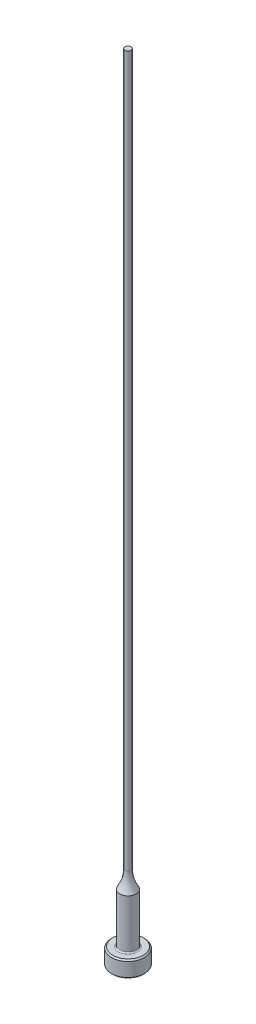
ISO-10303-21;
HEADER;
FILE_DESCRIPTION(('STEP AP214'),'2;1');
FILE_NAME('part.step','',(''),(''),'','','');
FILE_SCHEMA(('AUTOMOTIVE_DESIGN { 1 0 10303 214 1 1 1 1 }'));
ENDSEC;
DATA;
#1=APPLICATION_CONTEXT('core data for automotive mechanical design processes');
#2=APPLICATION_PROTOCOL_DEFINITION('international standard','automotive_design',2000,#1);
#3=PRODUCT_CONTEXT('',#1,'mechanical');
#4=PRODUCT('Part','Part','',(#3));
#5=PRODUCT_RELATED_PRODUCT_CATEGORY('part','',(#4));
#6=PRODUCT_DEFINITION_FORMATION('','',#4);
#7=PRODUCT_DEFINITION_CONTEXT('part definition',#1,'design');
#8=PRODUCT_DEFINITION('design','',#6,#7);
#9=PRODUCT_DEFINITION_SHAPE('','',#8);
#10=(LENGTH_UNIT() NAMED_UNIT(*) SI_UNIT(.MILLI.,.METRE.));
#11=(NAMED_UNIT(*) PLANE_ANGLE_UNIT() SI_UNIT($,.RADIAN.));
#12=(NAMED_UNIT(*) SI_UNIT($,.STERADIAN.) SOLID_ANGLE_UNIT());
#13=UNCERTAINTY_MEASURE_WITH_UNIT(LENGTH_MEASURE(1.E-05),#10,'distance_accuracy_value','');
#14=(GEOMETRIC_REPRESENTATION_CONTEXT(3) GLOBAL_UNCERTAINTY_ASSIGNED_CONTEXT((#13)) GLOBAL_UNIT_ASSIGNED_CONTEXT((#10,
#11,#12)) REPRESENTATION_CONTEXT('',''));
#15=CARTESIAN_POINT('',(0.,0.,0.));
#16=DIRECTION('',(0.,0.,1.));
#17=DIRECTION('',(1.,0.,0.));
#18=AXIS2_PLACEMENT_3D('',#15,#16,#17);
#19=CARTESIAN_POINT('',(-0.594359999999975,152.4,0.));
#20=DIRECTION('',(0.,1.,0.));
#21=DIRECTION('',(0.,0.,1.));
#22=AXIS2_PLACEMENT_3D('',#19,#20,#21);
#23=PLANE('',#22);
#24=CARTESIAN_POINT('',(0.,152.4,0.));
#25=DIRECTION('',(0.,1.,0.));
#26=DIRECTION('',(0.,0.,1.));
#27=AXIS2_PLACEMENT_3D('',#24,#25,#26);
#28=CIRCLE('',#27,0.594359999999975);
#29=CARTESIAN_POINT('',(0.,152.4,0.594359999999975));
#30=VERTEX_POINT('',#29);
#31=EDGE_CURVE('E61',#30,#30,#28,.T.);
#32=ORIENTED_EDGE('',*,*,#31,.T.);
#33=EDGE_LOOP('',(#32));
#34=FACE_BOUND('',#33,.T.);
#35=ADVANCED_FACE('F35',(#34),#23,.T.);
#36=CARTESIAN_POINT('',(0.,259.958771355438,0.));
#37=DIRECTION('',(0.,1.,0.));
#38=DIRECTION('',(0.,0.,1.));
#39=AXIS2_PLACEMENT_3D('',#36,#37,#38);
#40=CYLINDRICAL_SURFACE('',#39,0.594359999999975);
#41=CARTESIAN_POINT('',(0.,16.1097728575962,0.));
#42=DIRECTION('',(0.,1.,0.));
#43=DIRECTION('',(0.,0.,1.));
#44=AXIS2_PLACEMENT_3D('',#41,#42,#43);
#45=CIRCLE('',#44,0.594359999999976);
#46=CARTESIAN_POINT('',(0.,16.1097728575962,0.594359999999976));
#47=VERTEX_POINT('',#46);
#48=EDGE_CURVE('E64',#47,#47,#45,.T.);
#49=ORIENTED_EDGE('',*,*,#48,.T.);
#50=EDGE_LOOP('',(#49));
#51=FACE_BOUND('',#50,.T.);
#52=ORIENTED_EDGE('',*,*,#31,.F.);
#53=EDGE_LOOP('',(#52));
#54=FACE_BOUND('',#53,.T.);
#55=ADVANCED_FACE('F84',(#51,#54),#40,.T.);
#56=CARTESIAN_POINT('',(0.,16.1097728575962,0.));
#57=DIRECTION('',(0.,1.,0.));
#58=DIRECTION('',(0.,0.,1.));
#59=AXIS2_PLACEMENT_3D('',#56,#57,#58);
#60=TOROIDAL_SURFACE('',#59,6.94435999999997,6.35);
#61=CARTESIAN_POINT('',(0.,12.7,0.));
#62=DIRECTION('',(0.,1.,0.));
#63=DIRECTION('',(0.,0.,1.));
#64=AXIS2_PLACEMENT_3D('',#61,#62,#63);
#65=CIRCLE('',#64,1.58749999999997);
#66=CARTESIAN_POINT('',(0.,12.7,1.58749999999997));
#67=VERTEX_POINT('',#66);
#68=EDGE_CURVE('E67',#67,#67,#65,.T.);
#69=ORIENTED_EDGE('',*,*,#68,.T.);
#70=EDGE_LOOP('',(#69));
#71=FACE_BOUND('',#70,.T.);
#72=ORIENTED_EDGE('',*,*,#48,.F.);
#73=EDGE_LOOP('',(#72));
#74=FACE_BOUND('',#73,.T.);
#75=ADVANCED_FACE('F71',(#71,#74),#60,.F.);
#76=CARTESIAN_POINT('',(0.,259.958771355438,0.));
#77=DIRECTION('',(0.,1.,0.));
#78=DIRECTION('',(0.,0.,1.));
#79=AXIS2_PLACEMENT_3D('',#76,#77,#78);
#80=CYLINDRICAL_SURFACE('',#79,1.58749999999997);
#81=CARTESIAN_POINT('',(0.,3.42900000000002,0.));
#82=DIRECTION('',(0.,1.,0.));
#83=DIRECTION('',(0.,0.,1.));
#84=AXIS2_PLACEMENT_3D('',#81,#82,#83);
#85=CIRCLE('',#84,1.58749999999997);
#86=CARTESIAN_POINT('',(0.,3.42900000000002,1.58749999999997));
#87=VERTEX_POINT('',#86);
#88=EDGE_CURVE('E42',#87,#87,#85,.T.);
#89=ORIENTED_EDGE('',*,*,#88,.T.);
#90=EDGE_LOOP('',(#89));
#91=FACE_BOUND('',#90,.T.);
#92=ORIENTED_EDGE('',*,*,#68,.F.);
#93=EDGE_LOOP('',(#92));
#94=FACE_BOUND('',#93,.T.);
#95=ADVANCED_FACE('F74',(#91,#94),#80,.T.);
#96=CARTESIAN_POINT('',(-3.17499999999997,3.175,0.));
#97=DIRECTION('',(0.,1.,0.));
#98=DIRECTION('',(0.,0.,1.));
#99=AXIS2_PLACEMENT_3D('',#96,#97,#98);
#100=PLANE('',#99);
#101=CARTESIAN_POINT('',(0.,3.175,0.));
#102=DIRECTION('',(0.,1.,0.));
#103=DIRECTION('',(0.,0.,1.));
#104=AXIS2_PLACEMENT_3D('',#101,#102,#103);
#105=CIRCLE('',#104,1.84149999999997);
#106=CARTESIAN_POINT('',(0.,3.175,1.84149999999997));
#107=VERTEX_POINT('',#106);
#108=EDGE_CURVE('E10',#107,#107,#105,.F.);
#109=ORIENTED_EDGE('',*,*,#108,.T.);
#110=EDGE_LOOP('',(#109));
#111=FACE_BOUND('',#110,.T.);
#112=CARTESIAN_POINT('',(0.,3.175,0.));
#113=DIRECTION('',(0.,1.,0.));
#114=DIRECTION('',(0.,0.,1.));
#115=AXIS2_PLACEMENT_3D('',#112,#113,#114);
#116=CIRCLE('',#115,2.92099999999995);
#117=CARTESIAN_POINT('',(0.,3.175,2.92099999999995));
#118=VERTEX_POINT('',#117);
#119=EDGE_CURVE('E58',#118,#118,#116,.T.);
#120=ORIENTED_EDGE('',*,*,#119,.T.);
#121=EDGE_LOOP('',(#120));
#122=FACE_BOUND('',#121,.T.);
#123=ADVANCED_FACE('F76',(#111,#122),#100,.T.);
#124=CARTESIAN_POINT('',(0.,259.958771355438,0.));
#125=DIRECTION('',(0.,1.,0.));
#126=DIRECTION('',(0.,0.,1.));
#127=AXIS2_PLACEMENT_3D('',#124,#125,#126);
#128=CYLINDRICAL_SURFACE('',#127,3.17499999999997);
#129=CARTESIAN_POINT('',(0.,2.92100000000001,0.));
#130=DIRECTION('',(0.,1.,0.));
#131=DIRECTION('',(0.,0.,1.));
#132=AXIS2_PLACEMENT_3D('',#129,#130,#131);
#133=CIRCLE('',#132,3.17499999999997);
#134=CARTESIAN_POINT('',(0.,2.92100000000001,3.17499999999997));
#135=VERTEX_POINT('',#134);
#136=EDGE_CURVE('E50',#135,#135,#133,.F.);
#137=ORIENTED_EDGE('',*,*,#136,.T.);
#138=EDGE_LOOP('',(#137));
#139=FACE_BOUND('',#138,.T.);
#140=CARTESIAN_POINT('',(0.,0.254000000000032,0.));
#141=DIRECTION('',(0.,-1.,0.));
#142=DIRECTION('',(0.,0.,-1.));
#143=AXIS2_PLACEMENT_3D('',#140,#141,#142);
#144=CIRCLE('',#143,3.17499999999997);
#145=CARTESIAN_POINT('',(0.,0.254000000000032,-3.17499999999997));
#146=VERTEX_POINT('',#145);
#147=EDGE_CURVE('E55',#146,#146,#144,.F.);
#148=ORIENTED_EDGE('',*,*,#147,.T.);
#149=EDGE_LOOP('',(#148));
#150=FACE_BOUND('',#149,.T.);
#151=ADVANCED_FACE('F82',(#139,#150),#128,.T.);
#152=CARTESIAN_POINT('',(0.,0.,0.));
#153=DIRECTION('',(0.,-1.,0.));
#154=DIRECTION('',(0.,0.,-1.));
#155=AXIS2_PLACEMENT_3D('',#152,#153,#154);
#156=PLANE('',#155);
#157=CARTESIAN_POINT('',(0.,0.,0.));
#158=DIRECTION('',(0.,-1.,0.));
#159=DIRECTION('',(0.,0.,-1.));
#160=AXIS2_PLACEMENT_3D('',#157,#158,#159);
#161=CIRCLE('',#160,2.92099999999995);
#162=CARTESIAN_POINT('',(0.,0.,-2.92099999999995));
#163=VERTEX_POINT('',#162);
#164=EDGE_CURVE('E46',#163,#163,#161,.T.);
#165=ORIENTED_EDGE('',*,*,#164,.T.);
#166=EDGE_LOOP('',(#165));
#167=FACE_BOUND('',#166,.T.);
#168=ADVANCED_FACE('F98',(#167),#156,.T.);
#169=CARTESIAN_POINT('',(0.,3.17499999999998,0.));
#170=DIRECTION('',(0.,-1.,0.));
#171=DIRECTION('',(0.,0.,-1.));
#172=AXIS2_PLACEMENT_3D('',#169,#170,#171);
#173=CONICAL_SURFACE('',#172,2.92099999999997,0.7853981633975);
#174=ORIENTED_EDGE('',*,*,#136,.F.);
#175=EDGE_LOOP('',(#174));
#176=FACE_BOUND('',#175,.T.);
#177=ORIENTED_EDGE('',*,*,#119,.F.);
#178=EDGE_LOOP('',(#177));
#179=FACE_BOUND('',#178,.T.);
#180=ADVANCED_FACE('F95',(#176,#179),#173,.T.);
#181=CARTESIAN_POINT('',(0.,0.254000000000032,0.));
#182=DIRECTION('',(0.,1.,0.));
#183=DIRECTION('',(0.,0.,1.));
#184=AXIS2_PLACEMENT_3D('',#181,#182,#183);
#185=CONICAL_SURFACE('',#184,3.17499999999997,0.785398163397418);
#186=ORIENTED_EDGE('',*,*,#164,.F.);
#187=EDGE_LOOP('',(#186));
#188=FACE_BOUND('',#187,.T.);
#189=ORIENTED_EDGE('',*,*,#147,.F.);
#190=EDGE_LOOP('',(#189));
#191=FACE_BOUND('',#190,.T.);
#192=ADVANCED_FACE('F97',(#188,#191),#185,.T.);
#193=CARTESIAN_POINT('',(0.,3.42900000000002,0.));
#194=DIRECTION('',(0.,1.,0.));
#195=DIRECTION('',(0.,0.,1.));
#196=AXIS2_PLACEMENT_3D('',#193,#194,#195);
#197=TOROIDAL_SURFACE('',#196,1.84149999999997,0.254);
#198=ORIENTED_EDGE('',*,*,#108,.F.);
#199=EDGE_LOOP('',(#198));
#200=FACE_BOUND('',#199,.T.);
#201=ORIENTED_EDGE('',*,*,#88,.F.);
#202=EDGE_LOOP('',(#201));
#203=FACE_BOUND('',#202,.T.);
#204=ADVANCED_FACE('F37',(#200,#203),#197,.F.);
#205=CLOSED_SHELL('',(#35,#55,#75,#95,#123,#151,#168,#180,#192,#204));
#206=MANIFOLD_SOLID_BREP('B2',#205);
#207=ADVANCED_BREP_SHAPE_REPRESENTATION('',(#18,#206),#14);
#208=SHAPE_DEFINITION_REPRESENTATION(#9,#207);
ENDSEC;
END-ISO-10303-21;
